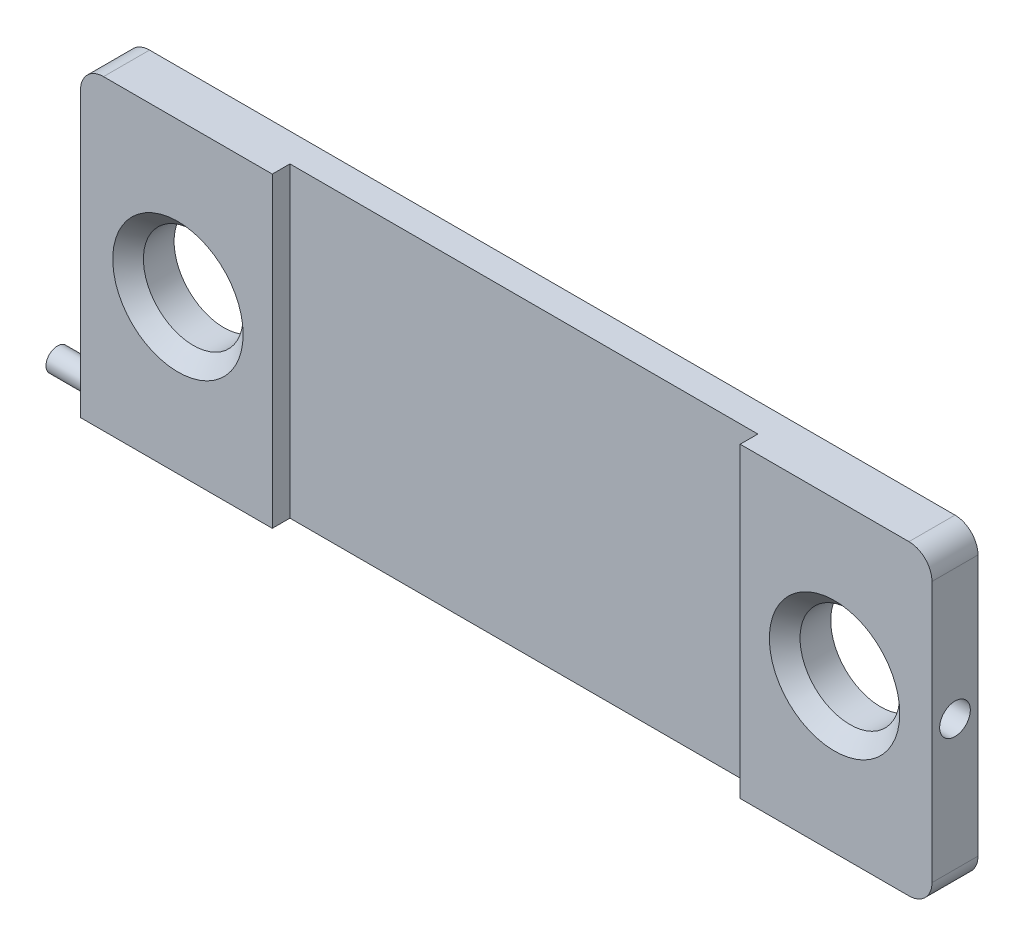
from build123d import *

# Parameters (mm, degrees)
ESQUISSE1_W               = 111
ESQUISSE1_H               = 40
ESQUISSE1_R               = 6.5
EXTRUSION1_DEPTH          = 3
CONG_1_R                  = 3
CHANFREIN1_SIZE           = 2
ESQUISSE2_W               = 61
ESQUISSE2_H               = 40
ENL_V_MAT_EXTRU_1_DEPTH   = 2.3
TROU_TARAUD_M3X0_51_D     = 2.5
TROU_TARAUD_M3X0_51_DEPTH = 7.5
TROU_TARAUD_M3X0_51_TIP   = 0.751075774
ESQUISSE5_R               = 1.5
BOSS_EXTRU_1_DEPTH        = 6


with BuildPart() as part:
    # Esquisse1 → Extrusion1 (new, symmetric)
    with BuildSketch(Plane.XY):
        Rectangle(ESQUISSE1_W, ESQUISSE1_H)
        with Locations((-42.8, 0)):
            Circle(ESQUISSE1_R, mode=Mode.SUBTRACT)
        with Locations((42.8, 0)):
            Circle(ESQUISSE1_R, mode=Mode.SUBTRACT)
    extrude(amount=EXTRUSION1_DEPTH, both=True)

    # Cong_1
    cong_1_edges = [part.edges().sort_by_distance(p)[0] for p in [
        (55.5, -20, 0),
        (-55.5, 20, 0),
        (55.5, 20, 0),
    ]]
    fillet(cong_1_edges, radius=CONG_1_R)

    # Chanfrein1
    chanfrein1_edges = [part.edges().sort_by_distance(p)[0] for p in [
        (-49.3, 0, 3),
        (36.3, 0, 3),
    ]]
    chamfer(chanfrein1_edges, length=CHANFREIN1_SIZE)

    # Esquisse2 → Enl_v. mat.-Extru.1 (cut)
    with BuildSketch(Plane.XY.offset(3)):
        Rectangle(ESQUISSE2_W, ESQUISSE2_H)
    extrude(amount=-ENL_V_MAT_EXTRU_1_DEPTH, mode=Mode.SUBTRACT)

    # Esquisse3 → D_gagement M1.61 (revolve, cut)
    with BuildSketch(Plane(origin=(-55.5, 0, 0), x_dir=(0, 0, 1), z_dir=(0, 1, 0))):
        Polygon((0, 0), (0, 5.7), (2, 3.7), (2, 0), align=None)
    d_gagement_m1_61 = revolve(axis=Axis((-61.85, 0, 0), (1, 0, 0)), mode=Mode.SUBTRACT)

    # Sym_trie1: D_gagement M1.61 across plane
    add(d_gagement_m1_61.mirror(Plane(origin=(0, 0, 0), x_dir=(0, 0, 1), z_dir=(1, 0, 0))), mode=Mode.SUBTRACT)

    # Trou taraud_ M3x0.51
    with Locations(Plane(origin=(-55.5, -17.9, 0), x_dir=(0, -1, 0), z_dir=(-1, 0, 0))):
        with Locations((0, 0)):
            Hole(TROU_TARAUD_M3X0_51_D / 2, depth=TROU_TARAUD_M3X0_51_DEPTH)
            with Locations((0, 0, -(TROU_TARAUD_M3X0_51_DEPTH + TROU_TARAUD_M3X0_51_TIP / 2))):  # 118° drill point
                Cone(0, TROU_TARAUD_M3X0_51_D / 2, TROU_TARAUD_M3X0_51_TIP, mode=Mode.SUBTRACT)

    # Esquisse5 → Boss.-Extru.1 (add, symmetric)
    with BuildSketch(Plane.ZY.offset(55.5)):
        with Locations(Location((0, -17.9, 0), (0, 0, 90))):
            Circle(ESQUISSE5_R)
    extrude(amount=BOSS_EXTRU_1_DEPTH, both=True)


solid = part.part
